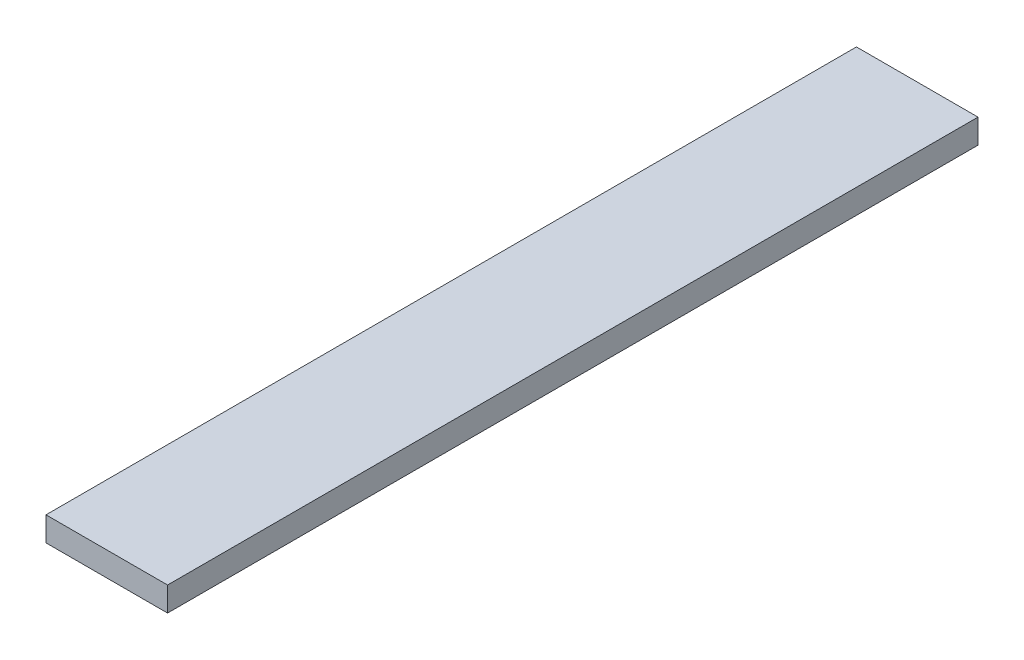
ISO-10303-21;
HEADER;
FILE_DESCRIPTION(('STEP AP214'),'2;1');
FILE_NAME('part.step','',(''),(''),'','','');
FILE_SCHEMA(('AUTOMOTIVE_DESIGN { 1 0 10303 214 1 1 1 1 }'));
ENDSEC;
DATA;
#1=APPLICATION_CONTEXT('core data for automotive mechanical design processes');
#2=APPLICATION_PROTOCOL_DEFINITION('international standard','automotive_design',2000,#1);
#3=PRODUCT_CONTEXT('',#1,'mechanical');
#4=PRODUCT('Part','Part','',(#3));
#5=PRODUCT_RELATED_PRODUCT_CATEGORY('part','',(#4));
#6=PRODUCT_DEFINITION_FORMATION('','',#4);
#7=PRODUCT_DEFINITION_CONTEXT('part definition',#1,'design');
#8=PRODUCT_DEFINITION('design','',#6,#7);
#9=PRODUCT_DEFINITION_SHAPE('','',#8);
#10=(LENGTH_UNIT() NAMED_UNIT(*) SI_UNIT(.MILLI.,.METRE.));
#11=(NAMED_UNIT(*) PLANE_ANGLE_UNIT() SI_UNIT($,.RADIAN.));
#12=(NAMED_UNIT(*) SI_UNIT($,.STERADIAN.) SOLID_ANGLE_UNIT());
#13=UNCERTAINTY_MEASURE_WITH_UNIT(LENGTH_MEASURE(1.E-05),#10,'distance_accuracy_value','');
#14=(GEOMETRIC_REPRESENTATION_CONTEXT(3) GLOBAL_UNCERTAINTY_ASSIGNED_CONTEXT((#13)) GLOBAL_UNIT_ASSIGNED_CONTEXT((#10,
#11,#12)) REPRESENTATION_CONTEXT('',''));
#15=CARTESIAN_POINT('',(0.,0.,0.));
#16=DIRECTION('',(0.,0.,1.));
#17=DIRECTION('',(1.,0.,0.));
#18=AXIS2_PLACEMENT_3D('',#15,#16,#17);
#19=CARTESIAN_POINT('',(30.,12.,-200.));
#20=DIRECTION('',(-1.,0.,0.));
#21=DIRECTION('',(0.,0.,1.));
#22=AXIS2_PLACEMENT_3D('',#19,#20,#21);
#23=PLANE('',#22);
#24=DIRECTION('',(0.,0.,-1.));
#25=VECTOR('',#24,1.);
#26=CARTESIAN_POINT('',(30.,0.,-200.));
#27=LINE('',#26,#25);
#28=CARTESIAN_POINT('',(30.,0.,200.));
#29=VERTEX_POINT('',#28);
#30=CARTESIAN_POINT('',(30.,0.,-200.));
#31=VERTEX_POINT('',#30);
#32=EDGE_CURVE('E96',#29,#31,#27,.T.);
#33=ORIENTED_EDGE('',*,*,#32,.T.);
#34=DIRECTION('',(0.,-1.,0.));
#35=VECTOR('',#34,1.);
#36=CARTESIAN_POINT('',(30.,12.,-200.));
#37=LINE('',#36,#35);
#38=CARTESIAN_POINT('',(30.,12.,-200.));
#39=VERTEX_POINT('',#38);
#40=EDGE_CURVE('E11',#39,#31,#37,.T.);
#41=ORIENTED_EDGE('',*,*,#40,.F.);
#42=DIRECTION('',(0.,0.,-1.));
#43=VECTOR('',#42,1.);
#44=CARTESIAN_POINT('',(30.,12.,-200.));
#45=LINE('',#44,#43);
#46=CARTESIAN_POINT('',(30.,12.,200.));
#47=VERTEX_POINT('',#46);
#48=EDGE_CURVE('E84',#47,#39,#45,.T.);
#49=ORIENTED_EDGE('',*,*,#48,.F.);
#50=DIRECTION('',(0.,-1.,0.));
#51=VECTOR('',#50,1.);
#52=CARTESIAN_POINT('',(30.,12.,200.));
#53=LINE('',#52,#51);
#54=EDGE_CURVE('E92',#47,#29,#53,.T.);
#55=ORIENTED_EDGE('',*,*,#54,.T.);
#56=EDGE_LOOP('',(#33,#41,#49,#55));
#57=FACE_BOUND('',#56,.T.);
#58=ADVANCED_FACE('F33',(#57),#23,.F.);
#59=CARTESIAN_POINT('',(-30.,12.,-200.));
#60=DIRECTION('',(0.,0.,1.));
#61=DIRECTION('',(1.,0.,0.));
#62=AXIS2_PLACEMENT_3D('',#59,#60,#61);
#63=PLANE('',#62);
#64=DIRECTION('',(-1.,0.,0.));
#65=VECTOR('',#64,1.);
#66=CARTESIAN_POINT('',(-30.,0.,-200.));
#67=LINE('',#66,#65);
#68=CARTESIAN_POINT('',(-30.,0.,-200.));
#69=VERTEX_POINT('',#68);
#70=EDGE_CURVE('E88',#31,#69,#67,.T.);
#71=ORIENTED_EDGE('',*,*,#70,.T.);
#72=DIRECTION('',(0.,-1.,0.));
#73=VECTOR('',#72,1.);
#74=CARTESIAN_POINT('',(-30.,12.,-200.));
#75=LINE('',#74,#73);
#76=CARTESIAN_POINT('',(-30.,12.,-200.));
#77=VERTEX_POINT('',#76);
#78=EDGE_CURVE('E41',#77,#69,#75,.T.);
#79=ORIENTED_EDGE('',*,*,#78,.F.);
#80=DIRECTION('',(-1.,0.,0.));
#81=VECTOR('',#80,1.);
#82=CARTESIAN_POINT('',(-30.,12.,-200.));
#83=LINE('',#82,#81);
#84=EDGE_CURVE('E79',#39,#77,#83,.T.);
#85=ORIENTED_EDGE('',*,*,#84,.F.);
#86=ORIENTED_EDGE('',*,*,#40,.T.);
#87=EDGE_LOOP('',(#71,#79,#85,#86));
#88=FACE_BOUND('',#87,.T.);
#89=ADVANCED_FACE('F87',(#88),#63,.F.);
#90=CARTESIAN_POINT('',(-30.,12.,-200.));
#91=DIRECTION('',(1.,0.,0.));
#92=DIRECTION('',(0.,0.,-1.));
#93=AXIS2_PLACEMENT_3D('',#90,#91,#92);
#94=PLANE('',#93);
#95=DIRECTION('',(0.,0.,1.));
#96=VECTOR('',#95,1.);
#97=CARTESIAN_POINT('',(-30.,0.,-200.));
#98=LINE('',#97,#96);
#99=CARTESIAN_POINT('',(-30.,0.,200.));
#100=VERTEX_POINT('',#99);
#101=EDGE_CURVE('E66',#69,#100,#98,.T.);
#102=ORIENTED_EDGE('',*,*,#101,.T.);
#103=DIRECTION('',(0.,-1.,0.));
#104=VECTOR('',#103,1.);
#105=CARTESIAN_POINT('',(-30.,12.,200.));
#106=LINE('',#105,#104);
#107=CARTESIAN_POINT('',(-30.,12.,200.));
#108=VERTEX_POINT('',#107);
#109=EDGE_CURVE('E89',#108,#100,#106,.T.);
#110=ORIENTED_EDGE('',*,*,#109,.F.);
#111=DIRECTION('',(0.,0.,1.));
#112=VECTOR('',#111,1.);
#113=CARTESIAN_POINT('',(-30.,12.,-200.));
#114=LINE('',#113,#112);
#115=EDGE_CURVE('E82',#77,#108,#114,.T.);
#116=ORIENTED_EDGE('',*,*,#115,.F.);
#117=ORIENTED_EDGE('',*,*,#78,.T.);
#118=EDGE_LOOP('',(#102,#110,#116,#117));
#119=FACE_BOUND('',#118,.T.);
#120=ADVANCED_FACE('F90',(#119),#94,.F.);
#121=CARTESIAN_POINT('',(-30.,12.,200.));
#122=DIRECTION('',(0.,0.,-1.));
#123=DIRECTION('',(-1.,0.,0.));
#124=AXIS2_PLACEMENT_3D('',#121,#122,#123);
#125=PLANE('',#124);
#126=DIRECTION('',(1.,0.,0.));
#127=VECTOR('',#126,1.);
#128=CARTESIAN_POINT('',(-30.,0.,200.));
#129=LINE('',#128,#127);
#130=EDGE_CURVE('E72',#100,#29,#129,.T.);
#131=ORIENTED_EDGE('',*,*,#130,.T.);
#132=ORIENTED_EDGE('',*,*,#54,.F.);
#133=DIRECTION('',(1.,0.,0.));
#134=VECTOR('',#133,1.);
#135=CARTESIAN_POINT('',(-30.,12.,200.));
#136=LINE('',#135,#134);
#137=EDGE_CURVE('E49',#108,#47,#136,.T.);
#138=ORIENTED_EDGE('',*,*,#137,.F.);
#139=ORIENTED_EDGE('',*,*,#109,.T.);
#140=EDGE_LOOP('',(#131,#132,#138,#139));
#141=FACE_BOUND('',#140,.T.);
#142=ADVANCED_FACE('F103',(#141),#125,.F.);
#143=CARTESIAN_POINT('',(0.,12.,0.));
#144=DIRECTION('',(0.,1.,0.));
#145=DIRECTION('',(0.,0.,1.));
#146=AXIS2_PLACEMENT_3D('',#143,#144,#145);
#147=PLANE('',#146);
#148=ORIENTED_EDGE('',*,*,#48,.T.);
#149=ORIENTED_EDGE('',*,*,#84,.T.);
#150=ORIENTED_EDGE('',*,*,#115,.T.);
#151=ORIENTED_EDGE('',*,*,#137,.T.);
#152=EDGE_LOOP('',(#148,#149,#150,#151));
#153=FACE_BOUND('',#152,.T.);
#154=ADVANCED_FACE('F80',(#153),#147,.T.);
#155=CARTESIAN_POINT('',(0.,0.,0.));
#156=DIRECTION('',(0.,1.,0.));
#157=DIRECTION('',(0.,0.,1.));
#158=AXIS2_PLACEMENT_3D('',#155,#156,#157);
#159=PLANE('',#158);
#160=ORIENTED_EDGE('',*,*,#32,.F.);
#161=ORIENTED_EDGE('',*,*,#130,.F.);
#162=ORIENTED_EDGE('',*,*,#101,.F.);
#163=ORIENTED_EDGE('',*,*,#70,.F.);
#164=EDGE_LOOP('',(#160,#161,#162,#163));
#165=FACE_BOUND('',#164,.T.);
#166=ADVANCED_FACE('F106',(#165),#159,.F.);
#167=CLOSED_SHELL('',(#58,#89,#120,#142,#154,#166));
#168=MANIFOLD_SOLID_BREP('B2',#167);
#169=ADVANCED_BREP_SHAPE_REPRESENTATION('',(#18,#168),#14);
#170=SHAPE_DEFINITION_REPRESENTATION(#9,#169);
ENDSEC;
END-ISO-10303-21;
